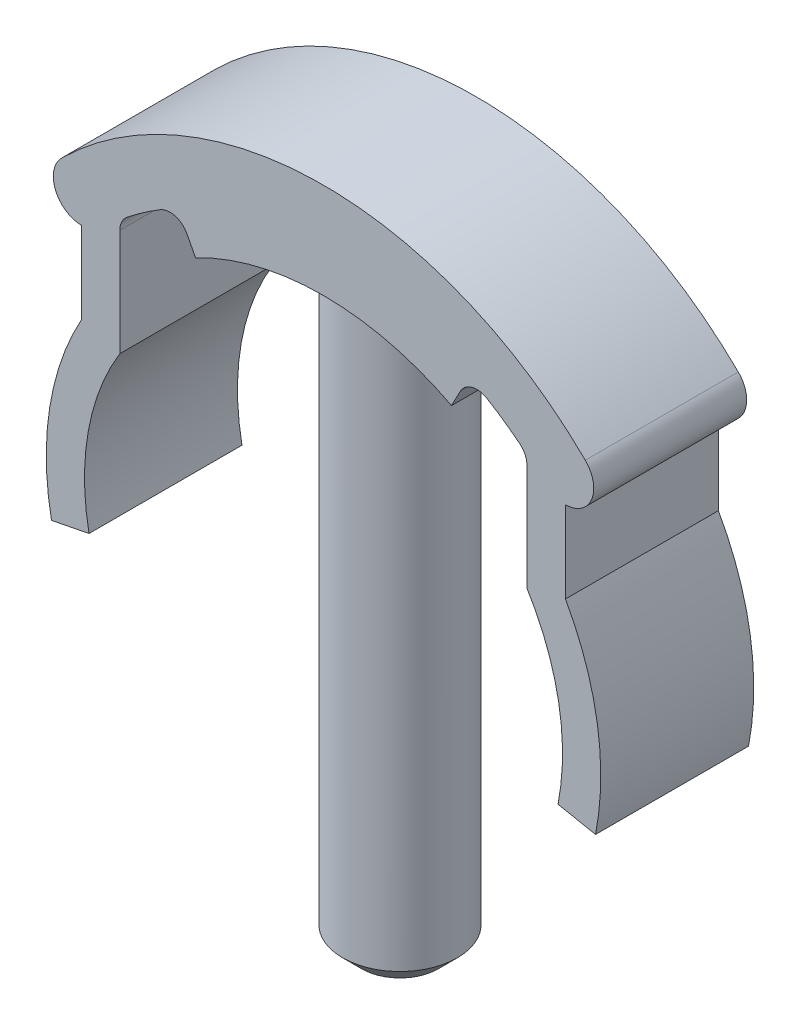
ISO-10303-21;
HEADER;
FILE_DESCRIPTION(('STEP AP214'),'2;1');
FILE_NAME('part.step','',(''),(''),'','','');
FILE_SCHEMA(('AUTOMOTIVE_DESIGN { 1 0 10303 214 1 1 1 1 }'));
ENDSEC;
DATA;
#1=APPLICATION_CONTEXT('core data for automotive mechanical design processes');
#2=APPLICATION_PROTOCOL_DEFINITION('international standard','automotive_design',2000,#1);
#3=PRODUCT_CONTEXT('',#1,'mechanical');
#4=PRODUCT('Part','Part','',(#3));
#5=PRODUCT_RELATED_PRODUCT_CATEGORY('part','',(#4));
#6=PRODUCT_DEFINITION_FORMATION('','',#4);
#7=PRODUCT_DEFINITION_CONTEXT('part definition',#1,'design');
#8=PRODUCT_DEFINITION('design','',#6,#7);
#9=PRODUCT_DEFINITION_SHAPE('','',#8);
#10=(LENGTH_UNIT() NAMED_UNIT(*) SI_UNIT(.MILLI.,.METRE.));
#11=(NAMED_UNIT(*) PLANE_ANGLE_UNIT() SI_UNIT($,.RADIAN.));
#12=(NAMED_UNIT(*) SI_UNIT($,.STERADIAN.) SOLID_ANGLE_UNIT());
#13=UNCERTAINTY_MEASURE_WITH_UNIT(LENGTH_MEASURE(1.E-05),#10,'distance_accuracy_value','');
#14=(GEOMETRIC_REPRESENTATION_CONTEXT(3) GLOBAL_UNCERTAINTY_ASSIGNED_CONTEXT((#13)) GLOBAL_UNIT_ASSIGNED_CONTEXT((#10,
#11,#12)) REPRESENTATION_CONTEXT('',''));
#15=CARTESIAN_POINT('',(0.,0.,0.));
#16=DIRECTION('',(0.,0.,1.));
#17=DIRECTION('',(1.,0.,0.));
#18=AXIS2_PLACEMENT_3D('',#15,#16,#17);
#19=CARTESIAN_POINT('',(0.,0.,8.));
#20=DIRECTION('',(0.,0.,-1.));
#21=DIRECTION('',(-1.,0.,0.));
#22=AXIS2_PLACEMENT_3D('',#19,#20,#21);
#23=CYLINDRICAL_SURFACE('',#22,14.5);
#24=CARTESIAN_POINT('',(0.,0.,0.));
#25=DIRECTION('',(0.,0.,1.));
#26=DIRECTION('',(1.,0.,0.));
#27=AXIS2_PLACEMENT_3D('',#24,#25,#26);
#28=CIRCLE('',#27,14.5);
#29=CARTESIAN_POINT('',(6.69367429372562,12.8625318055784,0.));
#30=VERTEX_POINT('',#29);
#31=CARTESIAN_POINT('',(-6.69367429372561,12.8625318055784,0.));
#32=VERTEX_POINT('',#31);
#33=EDGE_CURVE('E220',#30,#32,#28,.T.);
#34=ORIENTED_EDGE('',*,*,#33,.F.);
#35=DIRECTION('',(0.,0.,-1.));
#36=VECTOR('',#35,1.);
#37=CARTESIAN_POINT('',(6.69367429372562,12.8625318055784,8.));
#38=LINE('',#37,#36);
#39=CARTESIAN_POINT('',(6.69367429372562,12.8625318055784,8.));
#40=VERTEX_POINT('',#39);
#41=EDGE_CURVE('E311',#40,#30,#38,.T.);
#42=ORIENTED_EDGE('',*,*,#41,.F.);
#43=CARTESIAN_POINT('',(0.,0.,8.));
#44=DIRECTION('',(0.,0.,1.));
#45=DIRECTION('',(1.,0.,0.));
#46=AXIS2_PLACEMENT_3D('',#43,#44,#45);
#47=CIRCLE('',#46,14.5);
#48=CARTESIAN_POINT('',(-6.69367429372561,12.8625318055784,8.));
#49=VERTEX_POINT('',#48);
#50=EDGE_CURVE('E358',#40,#49,#47,.T.);
#51=ORIENTED_EDGE('',*,*,#50,.T.);
#52=DIRECTION('',(0.,0.,-1.));
#53=VECTOR('',#52,1.);
#54=CARTESIAN_POINT('',(-6.69367429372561,12.8625318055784,8.));
#55=LINE('',#54,#53);
#56=EDGE_CURVE('E313',#49,#32,#55,.T.);
#57=ORIENTED_EDGE('',*,*,#56,.T.);
#58=EDGE_LOOP('',(#34,#42,#51,#57));
#59=FACE_BOUND('',#58,.T.);
#60=CARTESIAN_POINT('',(0.,14.5,1.));
#61=CARTESIAN_POINT('',(0.16660780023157,14.4999969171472,1.00000597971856));
#62=CARTESIAN_POINT('',(0.333289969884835,14.497099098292,1.01392596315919));
#63=CARTESIAN_POINT('',(0.661934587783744,14.4858187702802,1.06918903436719));
#64=CARTESIAN_POINT('',(0.823893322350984,14.4774320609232,1.11055312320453));
#65=CARTESIAN_POINT('',(1.1382926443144,14.4561094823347,1.21936519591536));
#66=CARTESIAN_POINT('',(1.29074247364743,14.4431781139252,1.2867873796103));
#67=CARTESIAN_POINT('',(1.58215766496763,14.4141683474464,1.44572320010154));
#68=CARTESIAN_POINT('',(1.72112366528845,14.3980900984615,1.53723569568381));
#69=CARTESIAN_POINT('',(1.98364227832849,14.3642935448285,1.74315480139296));
#70=CARTESIAN_POINT('',(2.10697214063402,14.3465567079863,1.85784237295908));
#71=CARTESIAN_POINT('',(2.33278785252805,14.311575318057,2.10625237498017));
#72=CARTESIAN_POINT('',(2.43527199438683,14.2943308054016,2.23997636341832));
#73=CARTESIAN_POINT('',(2.61744767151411,14.262104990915,2.52428159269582));
#74=CARTESIAN_POINT('',(2.69690623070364,14.2471475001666,2.67501505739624));
#75=CARTESIAN_POINT('',(2.82928200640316,14.2214535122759,2.98805456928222));
#76=CARTESIAN_POINT('',(2.88220204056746,14.2107165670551,3.15035938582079));
#77=CARTESIAN_POINT('',(2.95927072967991,14.1948673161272,3.47953056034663));
#78=CARTESIAN_POINT('',(2.98381150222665,14.1896784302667,3.64630134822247));
#79=CARTESIAN_POINT('',(3.00464346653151,14.1852824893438,3.98166762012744));
#80=CARTESIAN_POINT('',(3.00093775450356,14.1860747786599,4.15026290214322));
#81=CARTESIAN_POINT('',(2.96569844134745,14.193482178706,4.48160709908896));
#82=CARTESIAN_POINT('',(2.93461648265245,14.2000027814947,4.64440647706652));
#83=CARTESIAN_POINT('',(2.84622082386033,14.2179830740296,4.96242893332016));
#84=CARTESIAN_POINT('',(2.78890579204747,14.2294430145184,5.11765162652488));
#85=CARTESIAN_POINT('',(2.64924566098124,14.25610610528,5.4174046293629));
#86=CARTESIAN_POINT('',(2.56672347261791,14.271335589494,5.56184999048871));
#87=CARTESIAN_POINT('',(2.37911632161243,14.3038051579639,5.83501160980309));
#88=CARTESIAN_POINT('',(2.27402859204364,14.3210454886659,5.96372593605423));
#89=CARTESIAN_POINT('',(2.04186506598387,14.3560022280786,6.20437578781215));
#90=CARTESIAN_POINT('',(1.91440429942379,14.3737214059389,6.31593984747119));
#91=CARTESIAN_POINT('',(1.64238706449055,14.4073354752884,6.51616478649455));
#92=CARTESIAN_POINT('',(1.49783034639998,14.4232303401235,6.60482533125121));
#93=CARTESIAN_POINT('',(1.19529742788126,14.4514482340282,6.75680341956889));
#94=CARTESIAN_POINT('',(1.03729815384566,14.4637649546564,6.82007627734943));
#95=CARTESIAN_POINT('',(0.712600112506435,14.4833913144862,6.9190748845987));
#96=CARTESIAN_POINT('',(0.545902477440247,14.4907016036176,6.95480420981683));
#97=CARTESIAN_POINT('',(0.211729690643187,14.4994001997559,6.99717047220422));
#98=CARTESIAN_POINT('',(0.0443215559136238,14.5008919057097,7.00431542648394));
#99=CARTESIAN_POINT('',(-0.289296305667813,14.4980733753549,6.99068143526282));
#100=CARTESIAN_POINT('',(-0.455506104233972,14.4937634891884,6.96990417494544));
#101=CARTESIAN_POINT('',(-0.780354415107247,14.4798909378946,6.90143734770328));
#102=CARTESIAN_POINT('',(-0.939050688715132,14.4703795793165,6.85401052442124));
#103=CARTESIAN_POINT('',(-1.24623744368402,14.4471672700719,6.73387957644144));
#104=CARTESIAN_POINT('',(-1.39472712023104,14.4334659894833,6.66117346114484));
#105=CARTESIAN_POINT('',(-1.67941316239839,14.4031368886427,6.49146335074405));
#106=CARTESIAN_POINT('',(-1.81542489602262,14.3864733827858,6.39415615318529));
#107=CARTESIAN_POINT('',(-2.06937139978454,14.3521479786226,6.1784096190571));
#108=CARTESIAN_POINT('',(-2.18730408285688,14.3344859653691,6.05996784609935));
#109=CARTESIAN_POINT('',(-2.40372275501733,14.2998025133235,5.80299472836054));
#110=CARTESIAN_POINT('',(-2.50185886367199,14.2827962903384,5.66416630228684));
#111=CARTESIAN_POINT('',(-2.67342153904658,14.2516823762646,5.37169811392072));
#112=CARTESIAN_POINT('',(-2.746849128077,14.2375745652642,5.21805896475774));
#113=CARTESIAN_POINT('',(-2.8664435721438,14.2139797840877,4.90112624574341));
#114=CARTESIAN_POINT('',(-2.91275662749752,14.2044680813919,4.73788977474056));
#115=CARTESIAN_POINT('',(-2.97724578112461,14.1910926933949,4.40573237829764));
#116=CARTESIAN_POINT('',(-2.99542584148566,14.1872282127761,4.23681225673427));
#117=CARTESIAN_POINT('',(-3.00297832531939,14.185631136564,3.9016005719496));
#118=CARTESIAN_POINT('',(-2.99290425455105,14.187780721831,3.73532179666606));
#119=CARTESIAN_POINT('',(-2.94546170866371,14.1977051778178,3.40688470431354));
#120=CARTESIAN_POINT('',(-2.90809348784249,14.2054799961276,3.24472634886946));
#121=CARTESIAN_POINT('',(-2.80737778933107,14.2257244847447,2.92951675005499));
#122=CARTESIAN_POINT('',(-2.74410274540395,14.2381810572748,2.77644146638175));
#123=CARTESIAN_POINT('',(-2.59343500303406,14.2663920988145,2.48299457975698));
#124=CARTESIAN_POINT('',(-2.5060401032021,14.2821468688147,2.34262413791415));
#125=CARTESIAN_POINT('',(-2.30774256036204,14.3155365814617,2.07582516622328));
#126=CARTESIAN_POINT('',(-2.19644204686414,14.3332004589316,1.94969591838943));
#127=CARTESIAN_POINT('',(-1.95430886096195,14.3682153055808,1.71772206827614));
#128=CARTESIAN_POINT('',(-1.82347169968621,14.385566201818,1.6118821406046));
#129=CARTESIAN_POINT('',(-1.54419363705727,14.4182327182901,1.42235166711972));
#130=CARTESIAN_POINT('',(-1.39556989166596,14.4335230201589,1.33892597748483));
#131=CARTESIAN_POINT('',(-1.08613294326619,14.4600948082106,1.19836854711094));
#132=CARTESIAN_POINT('',(-0.925330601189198,14.4713798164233,1.14121369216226));
#133=CARTESIAN_POINT('',(-0.636863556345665,14.4865407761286,1.06557536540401));
#134=CARTESIAN_POINT('',(-0.510813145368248,14.4915578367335,1.04102953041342));
#135=CARTESIAN_POINT('',(-0.256523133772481,14.4982885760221,1.00823983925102));
#136=CARTESIAN_POINT('',(-0.128283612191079,14.5000023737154,0.999995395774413));
#137=CARTESIAN_POINT('',(0.,14.5,1.));
#138=B_SPLINE_CURVE_WITH_KNOTS('',3,(#60,#61,#62,#63,#64,#65,#66,#67,#68,#69,#70,#71,#72,#73,
#74,#75,#76,#77,#78,#79,#80,#81,#82,#83,#84,#85,#86,#87,#88,#89,#90,#91,#92,#93,#94,#95,#96,#97,
#98,#99,#100,#101,#102,#103,#104,#105,#106,#107,#108,#109,#110,#111,#112,#113,#114,#115,#116,
#117,#118,#119,#120,#121,#122,#123,#124,#125,#126,#127,#128,#129,#130,#131,#132,#133,#134,#135,
#136,#137),.UNSPECIFIED.,.T.,.F.,(4,2,2,2,2,2,2,2,2,2,2,2,2,2,2,2,2,2,2,2,2,2,2,2,2,2,2,2,2,2,2,
2,2,2,2,2,2,2,4),(0.,0.49935400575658,0.999090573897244,1.49833361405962,1.99755300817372,
2.50323314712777,3.00895469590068,3.51962754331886,4.03024615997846,4.53372190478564,
5.03714246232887,5.53241016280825,6.02770300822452,6.52655876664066,7.02547572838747,
7.53401467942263,8.04256105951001,8.55199866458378,9.06137012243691,9.56164742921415,
10.0618945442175,10.5572940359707,11.0527325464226,11.5546032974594,12.0565319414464,
12.5666757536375,13.0767984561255,13.5841446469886,14.091419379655,14.5888262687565,
15.0862285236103,15.5822494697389,16.0783157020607,16.5833854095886,17.0885713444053,
17.5994875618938,18.1099533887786,18.4944566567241,18.8789460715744),.UNSPECIFIED.);
#139=CARTESIAN_POINT('',(0.,14.5,1.));
#140=VERTEX_POINT('',#139);
#141=EDGE_CURVE('E217',#140,#140,#138,.T.);
#142=ORIENTED_EDGE('',*,*,#141,.F.);
#143=EDGE_LOOP('',(#142));
#144=FACE_BOUND('',#143,.T.);
#145=ADVANCED_FACE('F33',(#59,#144),#23,.F.);
#146=CARTESIAN_POINT('',(-8.02747125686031,13.2593252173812,8.));
#147=DIRECTION('',(0.,0.,-1.));
#148=DIRECTION('',(-1.,0.,0.));
#149=AXIS2_PLACEMENT_3D('',#146,#147,#148);
#150=CYLINDRICAL_SURFACE('',#149,1.);
#151=CARTESIAN_POINT('',(-8.02747125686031,13.2593252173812,0.));
#152=DIRECTION('',(0.,0.,1.));
#153=DIRECTION('',(1.,0.,0.));
#154=AXIS2_PLACEMENT_3D('',#151,#152,#153);
#155=CIRCLE('',#154,1.);
#156=CARTESIAN_POINT('',(-7.1404000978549,13.7209579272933,0.));
#157=VERTEX_POINT('',#156);
#158=CARTESIAN_POINT('',(-8.54537262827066,14.1147655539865,0.));
#159=VERTEX_POINT('',#158);
#160=EDGE_CURVE('E214',#157,#159,#155,.T.);
#161=ORIENTED_EDGE('',*,*,#160,.F.);
#162=DIRECTION('',(0.,0.,-1.));
#163=VECTOR('',#162,1.);
#164=CARTESIAN_POINT('',(-7.1404000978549,13.7209579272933,8.));
#165=LINE('',#164,#163);
#166=CARTESIAN_POINT('',(-7.1404000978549,13.7209579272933,8.));
#167=VERTEX_POINT('',#166);
#168=EDGE_CURVE('E128',#167,#157,#165,.T.);
#169=ORIENTED_EDGE('',*,*,#168,.F.);
#170=CARTESIAN_POINT('',(-8.02747125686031,13.2593252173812,8.));
#171=DIRECTION('',(0.,0.,1.));
#172=DIRECTION('',(1.,0.,0.));
#173=AXIS2_PLACEMENT_3D('',#170,#171,#172);
#174=CIRCLE('',#173,1.);
#175=CARTESIAN_POINT('',(-8.54537262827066,14.1147655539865,8.));
#176=VERTEX_POINT('',#175);
#177=EDGE_CURVE('E271',#167,#176,#174,.T.);
#178=ORIENTED_EDGE('',*,*,#177,.T.);
#179=DIRECTION('',(0.,0.,-1.));
#180=VECTOR('',#179,1.);
#181=CARTESIAN_POINT('',(-8.54537262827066,14.1147655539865,8.));
#182=LINE('',#181,#180);
#183=EDGE_CURVE('E50',#176,#159,#182,.T.);
#184=ORIENTED_EDGE('',*,*,#183,.T.);
#185=EDGE_LOOP('',(#161,#169,#178,#184));
#186=FACE_BOUND('',#185,.T.);
#187=ADVANCED_FACE('F329',(#186),#150,.F.);
#188=CARTESIAN_POINT('',(15.4344198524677,-29.6587057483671,8.));
#189=DIRECTION('',(-0.887071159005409,-0.461632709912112,0.));
#190=DIRECTION('',(0.461632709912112,-0.887071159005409,0.));
#191=AXIS2_PLACEMENT_3D('',#188,#189,#190);
#192=PLANE('',#191);
#193=DIRECTION('',(-0.461632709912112,0.887071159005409,0.));
#194=VECTOR('',#193,1.);
#195=CARTESIAN_POINT('',(15.4344198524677,-29.6587057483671,0.));
#196=LINE('',#195,#194);
#197=EDGE_CURVE('E216',#32,#157,#196,.T.);
#198=ORIENTED_EDGE('',*,*,#197,.F.);
#199=ORIENTED_EDGE('',*,*,#56,.F.);
#200=DIRECTION('',(-0.461632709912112,0.887071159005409,0.));
#201=VECTOR('',#200,1.);
#202=CARTESIAN_POINT('',(15.4344198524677,-29.6587057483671,8.));
#203=LINE('',#202,#201);
#204=EDGE_CURVE('E360',#49,#167,#203,.T.);
#205=ORIENTED_EDGE('',*,*,#204,.T.);
#206=ORIENTED_EDGE('',*,*,#168,.T.);
#207=EDGE_LOOP('',(#198,#199,#205,#206));
#208=FACE_BOUND('',#207,.T.);
#209=ADVANCED_FACE('F335',(#208),#192,.T.);
#210=CARTESIAN_POINT('',(-15.4344198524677,-29.6587057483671,8.));
#211=DIRECTION('',(-0.887071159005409,0.461632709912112,0.));
#212=DIRECTION('',(-0.461632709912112,-0.887071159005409,0.));
#213=AXIS2_PLACEMENT_3D('',#210,#211,#212);
#214=PLANE('',#213);
#215=DIRECTION('',(0.461632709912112,0.887071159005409,0.));
#216=VECTOR('',#215,1.);
#217=CARTESIAN_POINT('',(-15.4344198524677,-29.6587057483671,0.));
#218=LINE('',#217,#216);
#219=CARTESIAN_POINT('',(7.1404000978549,13.7209579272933,0.));
#220=VERTEX_POINT('',#219);
#221=EDGE_CURVE('E223',#30,#220,#218,.T.);
#222=ORIENTED_EDGE('',*,*,#221,.T.);
#223=DIRECTION('',(0.,0.,-1.));
#224=VECTOR('',#223,1.);
#225=CARTESIAN_POINT('',(7.1404000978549,13.7209579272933,8.));
#226=LINE('',#225,#224);
#227=CARTESIAN_POINT('',(7.1404000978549,13.7209579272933,8.));
#228=VERTEX_POINT('',#227);
#229=EDGE_CURVE('E309',#228,#220,#226,.T.);
#230=ORIENTED_EDGE('',*,*,#229,.F.);
#231=DIRECTION('',(0.461632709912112,0.887071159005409,0.));
#232=VECTOR('',#231,1.);
#233=CARTESIAN_POINT('',(-15.4344198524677,-29.6587057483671,8.));
#234=LINE('',#233,#232);
#235=EDGE_CURVE('E359',#40,#228,#234,.T.);
#236=ORIENTED_EDGE('',*,*,#235,.F.);
#237=ORIENTED_EDGE('',*,*,#41,.T.);
#238=EDGE_LOOP('',(#222,#230,#236,#237));
#239=FACE_BOUND('',#238,.T.);
#240=ADVANCED_FACE('F340',(#239),#214,.F.);
#241=CARTESIAN_POINT('',(8.02747125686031,13.2593252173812,8.));
#242=DIRECTION('',(0.,0.,-1.));
#243=DIRECTION('',(-1.,0.,0.));
#244=AXIS2_PLACEMENT_3D('',#241,#242,#243);
#245=CYLINDRICAL_SURFACE('',#244,1.);
#246=CARTESIAN_POINT('',(8.02747125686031,13.2593252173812,0.));
#247=DIRECTION('',(0.,0.,1.));
#248=DIRECTION('',(1.,0.,0.));
#249=AXIS2_PLACEMENT_3D('',#246,#247,#248);
#250=CIRCLE('',#249,1.);
#251=CARTESIAN_POINT('',(8.54537262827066,14.1147655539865,0.));
#252=VERTEX_POINT('',#251);
#253=EDGE_CURVE('E226',#252,#220,#250,.T.);
#254=ORIENTED_EDGE('',*,*,#253,.F.);
#255=DIRECTION('',(0.,0.,-1.));
#256=VECTOR('',#255,1.);
#257=CARTESIAN_POINT('',(8.54537262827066,14.1147655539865,8.));
#258=LINE('',#257,#256);
#259=CARTESIAN_POINT('',(8.54537262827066,14.1147655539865,8.));
#260=VERTEX_POINT('',#259);
#261=EDGE_CURVE('E307',#260,#252,#258,.T.);
#262=ORIENTED_EDGE('',*,*,#261,.F.);
#263=CARTESIAN_POINT('',(8.02747125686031,13.2593252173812,8.));
#264=DIRECTION('',(0.,0.,1.));
#265=DIRECTION('',(1.,0.,0.));
#266=AXIS2_PLACEMENT_3D('',#263,#264,#265);
#267=CIRCLE('',#266,1.);
#268=EDGE_CURVE('E362',#260,#228,#267,.T.);
#269=ORIENTED_EDGE('',*,*,#268,.T.);
#270=ORIENTED_EDGE('',*,*,#229,.T.);
#271=EDGE_LOOP('',(#254,#262,#269,#270));
#272=FACE_BOUND('',#271,.T.);
#273=ADVANCED_FACE('F347',(#272),#245,.F.);
#274=CARTESIAN_POINT('',(0.,0.,8.));
#275=DIRECTION('',(0.,0.,-1.));
#276=DIRECTION('',(-1.,0.,0.));
#277=AXIS2_PLACEMENT_3D('',#274,#275,#276);
#278=CYLINDRICAL_SURFACE('',#277,16.5);
#279=CARTESIAN_POINT('',(0.,0.,0.));
#280=DIRECTION('',(0.,0.,1.));
#281=DIRECTION('',(1.,0.,0.));
#282=AXIS2_PLACEMENT_3D('',#279,#280,#281);
#283=CIRCLE('',#282,16.5);
#284=CARTESIAN_POINT('',(10.2581611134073,12.9236268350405,0.));
#285=VERTEX_POINT('',#284);
#286=EDGE_CURVE('E229',#285,#252,#283,.T.);
#287=ORIENTED_EDGE('',*,*,#286,.F.);
#288=DIRECTION('',(0.,0.,-1.));
#289=VECTOR('',#288,1.);
#290=CARTESIAN_POINT('',(10.2581611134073,12.9236268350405,8.));
#291=LINE('',#290,#289);
#292=CARTESIAN_POINT('',(10.2581611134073,12.9236268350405,8.));
#293=VERTEX_POINT('',#292);
#294=EDGE_CURVE('E305',#293,#285,#291,.T.);
#295=ORIENTED_EDGE('',*,*,#294,.F.);
#296=CARTESIAN_POINT('',(0.,0.,8.));
#297=DIRECTION('',(0.,0.,1.));
#298=DIRECTION('',(1.,0.,0.));
#299=AXIS2_PLACEMENT_3D('',#296,#297,#298);
#300=CIRCLE('',#299,16.5);
#301=EDGE_CURVE('E369',#293,#260,#300,.T.);
#302=ORIENTED_EDGE('',*,*,#301,.T.);
#303=ORIENTED_EDGE('',*,*,#261,.T.);
#304=EDGE_LOOP('',(#287,#295,#302,#303));
#305=FACE_BOUND('',#304,.T.);
#306=ADVANCED_FACE('F466',(#305),#278,.F.);
#307=CARTESIAN_POINT('',(9.63645437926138,12.1403767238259,8.));
#308=DIRECTION('',(0.,0.,-1.));
#309=DIRECTION('',(-1.,0.,0.));
#310=AXIS2_PLACEMENT_3D('',#307,#308,#309);
#311=CYLINDRICAL_SURFACE('',#310,1.);
#312=CARTESIAN_POINT('',(9.63645437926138,12.1403767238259,0.));
#313=DIRECTION('',(0.,0.,1.));
#314=DIRECTION('',(1.,0.,0.));
#315=AXIS2_PLACEMENT_3D('',#312,#313,#314);
#316=CIRCLE('',#315,1.);
#317=CARTESIAN_POINT('',(10.6364543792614,12.1403767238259,0.));
#318=VERTEX_POINT('',#317);
#319=EDGE_CURVE('E232',#318,#285,#316,.T.);
#320=ORIENTED_EDGE('',*,*,#319,.F.);
#321=DIRECTION('',(0.,0.,-1.));
#322=VECTOR('',#321,1.);
#323=CARTESIAN_POINT('',(10.6364543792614,12.1403767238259,8.));
#324=LINE('',#323,#322);
#325=CARTESIAN_POINT('',(10.6364543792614,12.1403767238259,8.));
#326=VERTEX_POINT('',#325);
#327=EDGE_CURVE('E303',#326,#318,#324,.T.);
#328=ORIENTED_EDGE('',*,*,#327,.F.);
#329=CARTESIAN_POINT('',(9.63645437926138,12.1403767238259,8.));
#330=DIRECTION('',(0.,0.,1.));
#331=DIRECTION('',(1.,0.,0.));
#332=AXIS2_PLACEMENT_3D('',#329,#330,#331);
#333=CIRCLE('',#332,1.);
#334=EDGE_CURVE('E372',#326,#293,#333,.T.);
#335=ORIENTED_EDGE('',*,*,#334,.T.);
#336=ORIENTED_EDGE('',*,*,#294,.T.);
#337=EDGE_LOOP('',(#320,#328,#335,#336));
#338=FACE_BOUND('',#337,.T.);
#339=ADVANCED_FACE('F462',(#338),#311,.F.);
#340=CARTESIAN_POINT('',(10.6364543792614,-37.6907931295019,8.));
#341=DIRECTION('',(1.,0.,0.));
#342=DIRECTION('',(0.,1.,0.));
#343=AXIS2_PLACEMENT_3D('',#340,#341,#342);
#344=PLANE('',#343);
#345=DIRECTION('',(0.,-1.,0.));
#346=VECTOR('',#345,1.);
#347=CARTESIAN_POINT('',(10.6364543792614,-37.6907931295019,0.));
#348=LINE('',#347,#346);
#349=CARTESIAN_POINT('',(10.6364543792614,6.56626516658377,0.));
#350=VERTEX_POINT('',#349);
#351=EDGE_CURVE('E235',#318,#350,#348,.T.);
#352=ORIENTED_EDGE('',*,*,#351,.T.);
#353=DIRECTION('',(0.,0.,-1.));
#354=VECTOR('',#353,1.);
#355=CARTESIAN_POINT('',(10.6364543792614,6.56626516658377,8.));
#356=LINE('',#355,#354);
#357=CARTESIAN_POINT('',(10.6364543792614,6.56626516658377,8.));
#358=VERTEX_POINT('',#357);
#359=EDGE_CURVE('E301',#358,#350,#356,.T.);
#360=ORIENTED_EDGE('',*,*,#359,.F.);
#361=DIRECTION('',(0.,-1.,0.));
#362=VECTOR('',#361,1.);
#363=CARTESIAN_POINT('',(10.6364543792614,-37.6907931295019,8.));
#364=LINE('',#363,#362);
#365=EDGE_CURVE('E375',#326,#358,#364,.T.);
#366=ORIENTED_EDGE('',*,*,#365,.F.);
#367=ORIENTED_EDGE('',*,*,#327,.T.);
#368=EDGE_LOOP('',(#352,#360,#366,#367));
#369=FACE_BOUND('',#368,.T.);
#370=ADVANCED_FACE('F458',(#369),#344,.F.);
#371=CARTESIAN_POINT('',(0.,0.,8.));
#372=DIRECTION('',(0.,0.,-1.));
#373=DIRECTION('',(-1.,0.,0.));
#374=AXIS2_PLACEMENT_3D('',#371,#372,#373);
#375=CYLINDRICAL_SURFACE('',#374,12.5);
#376=CARTESIAN_POINT('',(0.,0.,0.));
#377=DIRECTION('',(0.,0.,1.));
#378=DIRECTION('',(1.,0.,0.));
#379=AXIS2_PLACEMENT_3D('',#376,#377,#378);
#380=CIRCLE('',#379,12.5);
#381=CARTESIAN_POINT('',(12.265,-2.41242098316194,0.));
#382=VERTEX_POINT('',#381);
#383=EDGE_CURVE('E238',#382,#350,#380,.T.);
#384=ORIENTED_EDGE('',*,*,#383,.F.);
#385=DIRECTION('',(0.,0.,-1.));
#386=VECTOR('',#385,1.);
#387=CARTESIAN_POINT('',(12.265,-2.41242098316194,8.));
#388=LINE('',#387,#386);
#389=CARTESIAN_POINT('',(12.265,-2.41242098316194,8.));
#390=VERTEX_POINT('',#389);
#391=EDGE_CURVE('E299',#390,#382,#388,.T.);
#392=ORIENTED_EDGE('',*,*,#391,.F.);
#393=CARTESIAN_POINT('',(0.,0.,8.));
#394=DIRECTION('',(0.,0.,1.));
#395=DIRECTION('',(1.,0.,0.));
#396=AXIS2_PLACEMENT_3D('',#393,#394,#395);
#397=CIRCLE('',#396,12.5);
#398=EDGE_CURVE('E377',#390,#358,#397,.T.);
#399=ORIENTED_EDGE('',*,*,#398,.T.);
#400=ORIENTED_EDGE('',*,*,#359,.T.);
#401=EDGE_LOOP('',(#384,#392,#399,#400));
#402=FACE_BOUND('',#401,.T.);
#403=ADVANCED_FACE('F454',(#402),#375,.F.);
#404=CARTESIAN_POINT('',(7.13733202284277,-1.40385238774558,8.));
#405=DIRECTION('',(0.192993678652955,0.9812,0.));
#406=DIRECTION('',(-0.9812,0.192993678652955,0.));
#407=AXIS2_PLACEMENT_3D('',#404,#405,#406);
#408=PLANE('',#407);
#409=DIRECTION('',(0.9812,-0.192993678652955,0.));
#410=VECTOR('',#409,1.);
#411=CARTESIAN_POINT('',(7.13733202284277,-1.40385238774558,0.));
#412=LINE('',#411,#410);
#413=CARTESIAN_POINT('',(14.2274,-2.79840834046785,0.));
#414=VERTEX_POINT('',#413);
#415=EDGE_CURVE('E241',#382,#414,#412,.T.);
#416=ORIENTED_EDGE('',*,*,#415,.T.);
#417=DIRECTION('',(0.,0.,-1.));
#418=VECTOR('',#417,1.);
#419=CARTESIAN_POINT('',(14.2274,-2.79840834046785,8.));
#420=LINE('',#419,#418);
#421=CARTESIAN_POINT('',(14.2274,-2.79840834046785,8.));
#422=VERTEX_POINT('',#421);
#423=EDGE_CURVE('E296',#422,#414,#420,.T.);
#424=ORIENTED_EDGE('',*,*,#423,.F.);
#425=DIRECTION('',(0.9812,-0.192993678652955,0.));
#426=VECTOR('',#425,1.);
#427=CARTESIAN_POINT('',(7.13733202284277,-1.40385238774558,8.));
#428=LINE('',#427,#426);
#429=EDGE_CURVE('E380',#390,#422,#428,.T.);
#430=ORIENTED_EDGE('',*,*,#429,.F.);
#431=ORIENTED_EDGE('',*,*,#391,.T.);
#432=EDGE_LOOP('',(#416,#424,#430,#431));
#433=FACE_BOUND('',#432,.T.);
#434=ADVANCED_FACE('F450',(#433),#408,.F.);
#435=CARTESIAN_POINT('',(0.,0.,8.));
#436=DIRECTION('',(0.,0.,-1.));
#437=DIRECTION('',(-1.,0.,0.));
#438=AXIS2_PLACEMENT_3D('',#435,#436,#437);
#439=CYLINDRICAL_SURFACE('',#438,14.5);
#440=CARTESIAN_POINT('',(0.,0.,0.));
#441=DIRECTION('',(0.,0.,1.));
#442=DIRECTION('',(1.,0.,0.));
#443=AXIS2_PLACEMENT_3D('',#440,#441,#442);
#444=CIRCLE('',#443,14.5);
#445=CARTESIAN_POINT('',(12.6535456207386,7.08080385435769,0.));
#446=VERTEX_POINT('',#445);
#447=EDGE_CURVE('E243',#414,#446,#444,.T.);
#448=ORIENTED_EDGE('',*,*,#447,.T.);
#449=DIRECTION('',(0.,0.,-1.));
#450=VECTOR('',#449,1.);
#451=CARTESIAN_POINT('',(12.6535456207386,7.08080385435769,8.));
#452=LINE('',#451,#450);
#453=CARTESIAN_POINT('',(12.6535456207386,7.08080385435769,8.));
#454=VERTEX_POINT('',#453);
#455=EDGE_CURVE('E294',#454,#446,#452,.T.);
#456=ORIENTED_EDGE('',*,*,#455,.F.);
#457=CARTESIAN_POINT('',(0.,0.,8.));
#458=DIRECTION('',(0.,0.,1.));
#459=DIRECTION('',(1.,0.,0.));
#460=AXIS2_PLACEMENT_3D('',#457,#458,#459);
#461=CIRCLE('',#460,14.5);
#462=EDGE_CURVE('E382',#422,#454,#461,.T.);
#463=ORIENTED_EDGE('',*,*,#462,.F.);
#464=ORIENTED_EDGE('',*,*,#423,.T.);
#465=EDGE_LOOP('',(#448,#456,#463,#464));
#466=FACE_BOUND('',#465,.T.);
#467=ADVANCED_FACE('F446',(#466),#439,.T.);
#468=CARTESIAN_POINT('',(12.6535456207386,-37.6907931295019,8.));
#469=DIRECTION('',(1.,0.,0.));
#470=DIRECTION('',(0.,1.,0.));
#471=AXIS2_PLACEMENT_3D('',#468,#469,#470);
#472=PLANE('',#471);
#473=DIRECTION('',(0.,-1.,0.));
#474=VECTOR('',#473,1.);
#475=CARTESIAN_POINT('',(12.6535456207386,-37.6907931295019,0.));
#476=LINE('',#475,#474);
#477=CARTESIAN_POINT('',(12.6535456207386,11.3528755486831,0.));
#478=VERTEX_POINT('',#477);
#479=EDGE_CURVE('E246',#478,#446,#476,.T.);
#480=ORIENTED_EDGE('',*,*,#479,.F.);
#481=DIRECTION('',(0.,0.,-1.));
#482=VECTOR('',#481,1.);
#483=CARTESIAN_POINT('',(12.6535456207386,11.3528755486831,8.));
#484=LINE('',#483,#482);
#485=CARTESIAN_POINT('',(12.6535456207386,11.3528755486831,8.));
#486=VERTEX_POINT('',#485);
#487=EDGE_CURVE('E292',#486,#478,#484,.T.);
#488=ORIENTED_EDGE('',*,*,#487,.F.);
#489=DIRECTION('',(0.,-1.,0.));
#490=VECTOR('',#489,1.);
#491=CARTESIAN_POINT('',(12.6535456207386,-37.6907931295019,8.));
#492=LINE('',#491,#490);
#493=EDGE_CURVE('E384',#486,#454,#492,.T.);
#494=ORIENTED_EDGE('',*,*,#493,.T.);
#495=ORIENTED_EDGE('',*,*,#455,.T.);
#496=EDGE_LOOP('',(#480,#488,#494,#495));
#497=FACE_BOUND('',#496,.T.);
#498=ADVANCED_FACE('F442',(#497),#472,.T.);
#499=CARTESIAN_POINT('',(12.6535456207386,12.8316680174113,8.));
#500=DIRECTION('',(0.,0.,-1.));
#501=DIRECTION('',(-1.,0.,0.));
#502=AXIS2_PLACEMENT_3D('',#499,#500,#501);
#503=CYLINDRICAL_SURFACE('',#502,1.47879246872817);
#504=CARTESIAN_POINT('',(12.6535456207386,12.8316680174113,0.));
#505=DIRECTION('',(0.,0.,1.));
#506=DIRECTION('',(1.,0.,0.));
#507=AXIS2_PLACEMENT_3D('',#504,#505,#506);
#508=CIRCLE('',#507,1.47879246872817);
#509=CARTESIAN_POINT('',(13.6918760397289,13.8846148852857,0.));
#510=VERTEX_POINT('',#509);
#511=EDGE_CURVE('E249',#478,#510,#508,.T.);
#512=ORIENTED_EDGE('',*,*,#511,.T.);
#513=DIRECTION('',(0.,0.,-1.));
#514=VECTOR('',#513,1.);
#515=CARTESIAN_POINT('',(13.6918760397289,13.8846148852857,8.));
#516=LINE('',#515,#514);
#517=CARTESIAN_POINT('',(13.6918760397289,13.8846148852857,8.));
#518=VERTEX_POINT('',#517);
#519=EDGE_CURVE('E289',#518,#510,#516,.T.);
#520=ORIENTED_EDGE('',*,*,#519,.F.);
#521=CARTESIAN_POINT('',(12.6535456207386,12.8316680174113,8.));
#522=DIRECTION('',(0.,0.,1.));
#523=DIRECTION('',(1.,0.,0.));
#524=AXIS2_PLACEMENT_3D('',#521,#522,#523);
#525=CIRCLE('',#524,1.47879246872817);
#526=EDGE_CURVE('E387',#486,#518,#525,.T.);
#527=ORIENTED_EDGE('',*,*,#526,.F.);
#528=ORIENTED_EDGE('',*,*,#487,.T.);
#529=EDGE_LOOP('',(#512,#520,#527,#528));
#530=FACE_BOUND('',#529,.T.);
#531=ADVANCED_FACE('F438',(#530),#503,.T.);
#532=CARTESIAN_POINT('',(0.,0.,8.));
#533=DIRECTION('',(0.,0.,-1.));
#534=DIRECTION('',(-1.,0.,0.));
#535=AXIS2_PLACEMENT_3D('',#532,#533,#534);
#536=CYLINDRICAL_SURFACE('',#535,19.5);
#537=CARTESIAN_POINT('',(0.,0.,0.));
#538=DIRECTION('',(0.,0.,1.));
#539=DIRECTION('',(1.,0.,0.));
#540=AXIS2_PLACEMENT_3D('',#537,#538,#539);
#541=CIRCLE('',#540,19.5);
#542=CARTESIAN_POINT('',(-13.6918760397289,13.8846148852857,0.));
#543=VERTEX_POINT('',#542);
#544=EDGE_CURVE('E251',#510,#543,#541,.T.);
#545=ORIENTED_EDGE('',*,*,#544,.T.);
#546=DIRECTION('',(0.,0.,-1.));
#547=VECTOR('',#546,1.);
#548=CARTESIAN_POINT('',(-13.6918760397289,13.8846148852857,8.));
#549=LINE('',#548,#547);
#550=CARTESIAN_POINT('',(-13.6918760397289,13.8846148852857,8.));
#551=VERTEX_POINT('',#550);
#552=EDGE_CURVE('E286',#551,#543,#549,.T.);
#553=ORIENTED_EDGE('',*,*,#552,.F.);
#554=CARTESIAN_POINT('',(0.,0.,8.));
#555=DIRECTION('',(0.,0.,1.));
#556=DIRECTION('',(1.,0.,0.));
#557=AXIS2_PLACEMENT_3D('',#554,#555,#556);
#558=CIRCLE('',#557,19.5);
#559=EDGE_CURVE('E389',#518,#551,#558,.T.);
#560=ORIENTED_EDGE('',*,*,#559,.F.);
#561=ORIENTED_EDGE('',*,*,#519,.T.);
#562=EDGE_LOOP('',(#545,#553,#560,#561));
#563=FACE_BOUND('',#562,.T.);
#564=ADVANCED_FACE('F434',(#563),#536,.T.);
#565=CARTESIAN_POINT('',(-12.6535456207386,12.8316680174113,8.));
#566=DIRECTION('',(0.,0.,-1.));
#567=DIRECTION('',(-1.,0.,0.));
#568=AXIS2_PLACEMENT_3D('',#565,#566,#567);
#569=CYLINDRICAL_SURFACE('',#568,1.47879246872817);
#570=CARTESIAN_POINT('',(-12.6535456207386,12.8316680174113,0.));
#571=DIRECTION('',(0.,0.,1.));
#572=DIRECTION('',(1.,0.,0.));
#573=AXIS2_PLACEMENT_3D('',#570,#571,#572);
#574=CIRCLE('',#573,1.47879246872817);
#575=CARTESIAN_POINT('',(-12.6535456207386,11.3528755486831,0.));
#576=VERTEX_POINT('',#575);
#577=EDGE_CURVE('E253',#543,#576,#574,.T.);
#578=ORIENTED_EDGE('',*,*,#577,.T.);
#579=DIRECTION('',(0.,0.,-1.));
#580=VECTOR('',#579,1.);
#581=CARTESIAN_POINT('',(-12.6535456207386,11.3528755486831,8.));
#582=LINE('',#581,#580);
#583=CARTESIAN_POINT('',(-12.6535456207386,11.3528755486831,8.));
#584=VERTEX_POINT('',#583);
#585=EDGE_CURVE('E283',#584,#576,#582,.T.);
#586=ORIENTED_EDGE('',*,*,#585,.F.);
#587=CARTESIAN_POINT('',(-12.6535456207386,12.8316680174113,8.));
#588=DIRECTION('',(0.,0.,1.));
#589=DIRECTION('',(1.,0.,0.));
#590=AXIS2_PLACEMENT_3D('',#587,#588,#589);
#591=CIRCLE('',#590,1.47879246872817);
#592=EDGE_CURVE('E391',#551,#584,#591,.T.);
#593=ORIENTED_EDGE('',*,*,#592,.F.);
#594=ORIENTED_EDGE('',*,*,#552,.T.);
#595=EDGE_LOOP('',(#578,#586,#593,#594));
#596=FACE_BOUND('',#595,.T.);
#597=ADVANCED_FACE('F430',(#596),#569,.T.);
#598=CARTESIAN_POINT('',(-12.6535456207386,-37.6907931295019,8.));
#599=DIRECTION('',(1.,0.,0.));
#600=DIRECTION('',(0.,1.,0.));
#601=AXIS2_PLACEMENT_3D('',#598,#599,#600);
#602=PLANE('',#601);
#603=DIRECTION('',(0.,-1.,0.));
#604=VECTOR('',#603,1.);
#605=CARTESIAN_POINT('',(-12.6535456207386,-37.6907931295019,0.));
#606=LINE('',#605,#604);
#607=CARTESIAN_POINT('',(-12.6535456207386,7.08080385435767,0.));
#608=VERTEX_POINT('',#607);
#609=EDGE_CURVE('E255',#576,#608,#606,.T.);
#610=ORIENTED_EDGE('',*,*,#609,.T.);
#611=DIRECTION('',(0.,0.,-1.));
#612=VECTOR('',#611,1.);
#613=CARTESIAN_POINT('',(-12.6535456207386,7.08080385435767,8.));
#614=LINE('',#613,#612);
#615=CARTESIAN_POINT('',(-12.6535456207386,7.08080385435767,8.));
#616=VERTEX_POINT('',#615);
#617=EDGE_CURVE('E280',#616,#608,#614,.T.);
#618=ORIENTED_EDGE('',*,*,#617,.F.);
#619=DIRECTION('',(0.,-1.,0.));
#620=VECTOR('',#619,1.);
#621=CARTESIAN_POINT('',(-12.6535456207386,-37.6907931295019,8.));
#622=LINE('',#621,#620);
#623=EDGE_CURVE('E393',#584,#616,#622,.T.);
#624=ORIENTED_EDGE('',*,*,#623,.F.);
#625=ORIENTED_EDGE('',*,*,#585,.T.);
#626=EDGE_LOOP('',(#610,#618,#624,#625));
#627=FACE_BOUND('',#626,.T.);
#628=ADVANCED_FACE('F426',(#627),#602,.F.);
#629=CARTESIAN_POINT('',(0.,0.,8.));
#630=DIRECTION('',(0.,0.,-1.));
#631=DIRECTION('',(-1.,0.,0.));
#632=AXIS2_PLACEMENT_3D('',#629,#630,#631);
#633=CYLINDRICAL_SURFACE('',#632,14.5);
#634=CARTESIAN_POINT('',(0.,0.,0.));
#635=DIRECTION('',(0.,0.,1.));
#636=DIRECTION('',(1.,0.,0.));
#637=AXIS2_PLACEMENT_3D('',#634,#635,#636);
#638=CIRCLE('',#637,14.5);
#639=CARTESIAN_POINT('',(-14.2274,-2.79840834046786,0.));
#640=VERTEX_POINT('',#639);
#641=EDGE_CURVE('E257',#608,#640,#638,.T.);
#642=ORIENTED_EDGE('',*,*,#641,.T.);
#643=DIRECTION('',(0.,0.,-1.));
#644=VECTOR('',#643,1.);
#645=CARTESIAN_POINT('',(-14.2274,-2.79840834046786,8.));
#646=LINE('',#645,#644);
#647=CARTESIAN_POINT('',(-14.2274,-2.79840834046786,8.));
#648=VERTEX_POINT('',#647);
#649=EDGE_CURVE('E277',#648,#640,#646,.T.);
#650=ORIENTED_EDGE('',*,*,#649,.F.);
#651=CARTESIAN_POINT('',(0.,0.,8.));
#652=DIRECTION('',(0.,0.,1.));
#653=DIRECTION('',(1.,0.,0.));
#654=AXIS2_PLACEMENT_3D('',#651,#652,#653);
#655=CIRCLE('',#654,14.5);
#656=EDGE_CURVE('E395',#616,#648,#655,.T.);
#657=ORIENTED_EDGE('',*,*,#656,.F.);
#658=ORIENTED_EDGE('',*,*,#617,.T.);
#659=EDGE_LOOP('',(#642,#650,#657,#658));
#660=FACE_BOUND('',#659,.T.);
#661=ADVANCED_FACE('F423',(#660),#633,.T.);
#662=CARTESIAN_POINT('',(-7.13733202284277,-1.40385238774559,8.));
#663=DIRECTION('',(-0.192993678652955,0.9812,0.));
#664=DIRECTION('',(-0.9812,-0.192993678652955,0.));
#665=AXIS2_PLACEMENT_3D('',#662,#663,#664);
#666=PLANE('',#665);
#667=DIRECTION('',(0.9812,0.192993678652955,0.));
#668=VECTOR('',#667,1.);
#669=CARTESIAN_POINT('',(-7.13733202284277,-1.40385238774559,0.));
#670=LINE('',#669,#668);
#671=CARTESIAN_POINT('',(-12.265,-2.41242098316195,0.));
#672=VERTEX_POINT('',#671);
#673=EDGE_CURVE('E259',#640,#672,#670,.T.);
#674=ORIENTED_EDGE('',*,*,#673,.T.);
#675=DIRECTION('',(0.,0.,-1.));
#676=VECTOR('',#675,1.);
#677=CARTESIAN_POINT('',(-12.265,-2.41242098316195,8.));
#678=LINE('',#677,#676);
#679=CARTESIAN_POINT('',(-12.265,-2.41242098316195,8.));
#680=VERTEX_POINT('',#679);
#681=EDGE_CURVE('E275',#680,#672,#678,.T.);
#682=ORIENTED_EDGE('',*,*,#681,.F.);
#683=DIRECTION('',(0.9812,0.192993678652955,0.));
#684=VECTOR('',#683,1.);
#685=CARTESIAN_POINT('',(-7.13733202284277,-1.40385238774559,8.));
#686=LINE('',#685,#684);
#687=EDGE_CURVE('E209',#648,#680,#686,.T.);
#688=ORIENTED_EDGE('',*,*,#687,.F.);
#689=ORIENTED_EDGE('',*,*,#649,.T.);
#690=EDGE_LOOP('',(#674,#682,#688,#689));
#691=FACE_BOUND('',#690,.T.);
#692=ADVANCED_FACE('F401',(#691),#666,.F.);
#693=CARTESIAN_POINT('',(0.,0.,8.));
#694=DIRECTION('',(0.,0.,-1.));
#695=DIRECTION('',(-1.,0.,0.));
#696=AXIS2_PLACEMENT_3D('',#693,#694,#695);
#697=CYLINDRICAL_SURFACE('',#696,12.5);
#698=CARTESIAN_POINT('',(0.,0.,0.));
#699=DIRECTION('',(0.,0.,1.));
#700=DIRECTION('',(1.,0.,0.));
#701=AXIS2_PLACEMENT_3D('',#698,#699,#700);
#702=CIRCLE('',#701,12.5);
#703=CARTESIAN_POINT('',(-10.6535456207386,6.53849873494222,0.));
#704=VERTEX_POINT('',#703);
#705=EDGE_CURVE('E262',#704,#672,#702,.T.);
#706=ORIENTED_EDGE('',*,*,#705,.F.);
#707=DIRECTION('',(0.,0.,-1.));
#708=VECTOR('',#707,1.);
#709=CARTESIAN_POINT('',(-10.6535456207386,6.53849873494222,8.));
#710=LINE('',#709,#708);
#711=CARTESIAN_POINT('',(-10.6535456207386,6.53849873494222,8.));
#712=VERTEX_POINT('',#711);
#713=EDGE_CURVE('E196',#712,#704,#710,.T.);
#714=ORIENTED_EDGE('',*,*,#713,.F.);
#715=CARTESIAN_POINT('',(0.,0.,8.));
#716=DIRECTION('',(0.,0.,1.));
#717=DIRECTION('',(1.,0.,0.));
#718=AXIS2_PLACEMENT_3D('',#715,#716,#717);
#719=CIRCLE('',#718,12.5);
#720=EDGE_CURVE('E207',#712,#680,#719,.T.);
#721=ORIENTED_EDGE('',*,*,#720,.T.);
#722=ORIENTED_EDGE('',*,*,#681,.T.);
#723=EDGE_LOOP('',(#706,#714,#721,#722));
#724=FACE_BOUND('',#723,.T.);
#725=ADVANCED_FACE('F405',(#724),#697,.F.);
#726=CARTESIAN_POINT('',(-10.6535456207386,-37.6907931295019,8.));
#727=DIRECTION('',(1.,0.,0.));
#728=DIRECTION('',(0.,0.,-1.));
#729=AXIS2_PLACEMENT_3D('',#726,#727,#728);
#730=PLANE('',#729);
#731=DIRECTION('',(0.,-1.,0.));
#732=VECTOR('',#731,1.);
#733=CARTESIAN_POINT('',(-10.6535456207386,-37.6907931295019,0.));
#734=LINE('',#733,#732);
#735=CARTESIAN_POINT('',(-10.6535456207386,12.1267908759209,0.));
#736=VERTEX_POINT('',#735);
#737=EDGE_CURVE('E193',#736,#704,#734,.T.);
#738=ORIENTED_EDGE('',*,*,#737,.F.);
#739=DIRECTION('',(0.,0.,-1.));
#740=VECTOR('',#739,1.);
#741=CARTESIAN_POINT('',(-10.6535456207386,12.1267908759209,8.));
#742=LINE('',#741,#740);
#743=CARTESIAN_POINT('',(-10.6535456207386,12.1267908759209,8.));
#744=VERTEX_POINT('',#743);
#745=EDGE_CURVE('E187',#744,#736,#742,.T.);
#746=ORIENTED_EDGE('',*,*,#745,.F.);
#747=DIRECTION('',(0.,-1.,0.));
#748=VECTOR('',#747,1.);
#749=CARTESIAN_POINT('',(-10.6535456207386,-37.6907931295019,8.));
#750=LINE('',#749,#748);
#751=EDGE_CURVE('E191',#744,#712,#750,.T.);
#752=ORIENTED_EDGE('',*,*,#751,.T.);
#753=ORIENTED_EDGE('',*,*,#713,.T.);
#754=EDGE_LOOP('',(#738,#746,#752,#753));
#755=FACE_BOUND('',#754,.T.);
#756=ADVANCED_FACE('F189',(#755),#730,.T.);
#757=CARTESIAN_POINT('',(-9.65354562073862,12.1267908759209,8.));
#758=DIRECTION('',(0.,0.,-1.));
#759=DIRECTION('',(-1.,0.,0.));
#760=AXIS2_PLACEMENT_3D('',#757,#758,#759);
#761=CYLINDRICAL_SURFACE('',#760,1.);
#762=CARTESIAN_POINT('',(-9.65354562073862,12.1267908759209,0.));
#763=DIRECTION('',(0.,0.,1.));
#764=DIRECTION('',(1.,0.,0.));
#765=AXIS2_PLACEMENT_3D('',#762,#763,#764);
#766=CIRCLE('',#765,1.);
#767=CARTESIAN_POINT('',(-10.276355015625,12.909164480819,0.));
#768=VERTEX_POINT('',#767);
#769=EDGE_CURVE('E266',#736,#768,#766,.F.);
#770=ORIENTED_EDGE('',*,*,#769,.T.);
#771=DIRECTION('',(0.,0.,-1.));
#772=VECTOR('',#771,1.);
#773=CARTESIAN_POINT('',(-10.276355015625,12.909164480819,8.));
#774=LINE('',#773,#772);
#775=CARTESIAN_POINT('',(-10.276355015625,12.909164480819,8.));
#776=VERTEX_POINT('',#775);
#777=EDGE_CURVE('E119',#776,#768,#774,.T.);
#778=ORIENTED_EDGE('',*,*,#777,.F.);
#779=CARTESIAN_POINT('',(-9.65354562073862,12.1267908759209,8.));
#780=DIRECTION('',(0.,0.,1.));
#781=DIRECTION('',(1.,0.,0.));
#782=AXIS2_PLACEMENT_3D('',#779,#780,#781);
#783=CIRCLE('',#782,1.);
#784=EDGE_CURVE('E198',#744,#776,#783,.F.);
#785=ORIENTED_EDGE('',*,*,#784,.F.);
#786=ORIENTED_EDGE('',*,*,#745,.T.);
#787=EDGE_LOOP('',(#770,#778,#785,#786));
#788=FACE_BOUND('',#787,.T.);
#789=ADVANCED_FACE('F199',(#788),#761,.F.);
#790=CARTESIAN_POINT('',(0.,0.,8.));
#791=DIRECTION('',(0.,0.,-1.));
#792=DIRECTION('',(-1.,0.,0.));
#793=AXIS2_PLACEMENT_3D('',#790,#791,#792);
#794=CYLINDRICAL_SURFACE('',#793,16.5);
#795=CARTESIAN_POINT('',(0.,0.,0.));
#796=DIRECTION('',(0.,0.,1.));
#797=DIRECTION('',(1.,0.,0.));
#798=AXIS2_PLACEMENT_3D('',#795,#796,#797);
#799=CIRCLE('',#798,16.5);
#800=EDGE_CURVE('E268',#159,#768,#799,.T.);
#801=ORIENTED_EDGE('',*,*,#800,.F.);
#802=ORIENTED_EDGE('',*,*,#183,.F.);
#803=CARTESIAN_POINT('',(0.,0.,8.));
#804=DIRECTION('',(0.,0.,1.));
#805=DIRECTION('',(1.,0.,0.));
#806=AXIS2_PLACEMENT_3D('',#803,#804,#805);
#807=CIRCLE('',#806,16.5);
#808=EDGE_CURVE('E202',#176,#776,#807,.T.);
#809=ORIENTED_EDGE('',*,*,#808,.T.);
#810=ORIENTED_EDGE('',*,*,#777,.T.);
#811=EDGE_LOOP('',(#801,#802,#809,#810));
#812=FACE_BOUND('',#811,.T.);
#813=ADVANCED_FACE('F406',(#812),#794,.F.);
#814=CARTESIAN_POINT('',(0.,-37.6907931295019,8.));
#815=DIRECTION('',(0.,0.,1.));
#816=DIRECTION('',(1.,0.,0.));
#817=AXIS2_PLACEMENT_3D('',#814,#815,#816);
#818=PLANE('',#817);
#819=ORIENTED_EDGE('',*,*,#177,.F.);
#820=ORIENTED_EDGE('',*,*,#204,.F.);
#821=ORIENTED_EDGE('',*,*,#50,.F.);
#822=ORIENTED_EDGE('',*,*,#235,.T.);
#823=ORIENTED_EDGE('',*,*,#268,.F.);
#824=ORIENTED_EDGE('',*,*,#301,.F.);
#825=ORIENTED_EDGE('',*,*,#334,.F.);
#826=ORIENTED_EDGE('',*,*,#365,.T.);
#827=ORIENTED_EDGE('',*,*,#398,.F.);
#828=ORIENTED_EDGE('',*,*,#429,.T.);
#829=ORIENTED_EDGE('',*,*,#462,.T.);
#830=ORIENTED_EDGE('',*,*,#493,.F.);
#831=ORIENTED_EDGE('',*,*,#526,.T.);
#832=ORIENTED_EDGE('',*,*,#559,.T.);
#833=ORIENTED_EDGE('',*,*,#592,.T.);
#834=ORIENTED_EDGE('',*,*,#623,.T.);
#835=ORIENTED_EDGE('',*,*,#656,.T.);
#836=ORIENTED_EDGE('',*,*,#687,.T.);
#837=ORIENTED_EDGE('',*,*,#720,.F.);
#838=ORIENTED_EDGE('',*,*,#751,.F.);
#839=ORIENTED_EDGE('',*,*,#784,.T.);
#840=ORIENTED_EDGE('',*,*,#808,.F.);
#841=EDGE_LOOP('',(#819,#820,#821,#822,#823,#824,#825,#826,#827,#828,#829,#830,#831,#832,#833,
#834,#835,#836,#837,#838,#839,#840));
#842=FACE_BOUND('',#841,.T.);
#843=ADVANCED_FACE('F205',(#842),#818,.T.);
#844=CARTESIAN_POINT('',(0.,-37.6907931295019,0.));
#845=DIRECTION('',(0.,0.,1.));
#846=DIRECTION('',(1.,0.,0.));
#847=AXIS2_PLACEMENT_3D('',#844,#845,#846);
#848=PLANE('',#847);
#849=ORIENTED_EDGE('',*,*,#160,.T.);
#850=ORIENTED_EDGE('',*,*,#800,.T.);
#851=ORIENTED_EDGE('',*,*,#769,.F.);
#852=ORIENTED_EDGE('',*,*,#737,.T.);
#853=ORIENTED_EDGE('',*,*,#705,.T.);
#854=ORIENTED_EDGE('',*,*,#673,.F.);
#855=ORIENTED_EDGE('',*,*,#641,.F.);
#856=ORIENTED_EDGE('',*,*,#609,.F.);
#857=ORIENTED_EDGE('',*,*,#577,.F.);
#858=ORIENTED_EDGE('',*,*,#544,.F.);
#859=ORIENTED_EDGE('',*,*,#511,.F.);
#860=ORIENTED_EDGE('',*,*,#479,.T.);
#861=ORIENTED_EDGE('',*,*,#447,.F.);
#862=ORIENTED_EDGE('',*,*,#415,.F.);
#863=ORIENTED_EDGE('',*,*,#383,.T.);
#864=ORIENTED_EDGE('',*,*,#351,.F.);
#865=ORIENTED_EDGE('',*,*,#319,.T.);
#866=ORIENTED_EDGE('',*,*,#286,.T.);
#867=ORIENTED_EDGE('',*,*,#253,.T.);
#868=ORIENTED_EDGE('',*,*,#221,.F.);
#869=ORIENTED_EDGE('',*,*,#33,.T.);
#870=ORIENTED_EDGE('',*,*,#197,.T.);
#871=EDGE_LOOP('',(#849,#850,#851,#852,#853,#854,#855,#856,#857,#858,#859,#860,#861,#862,#863,
#864,#865,#866,#867,#868,#869,#870));
#872=FACE_BOUND('',#871,.T.);
#873=ADVANCED_FACE('F354',(#872),#848,.F.);
#874=CARTESIAN_POINT('',(0.,19.501,4.));
#875=DIRECTION('',(0.,-1.,0.));
#876=DIRECTION('',(0.,0.,-1.));
#877=AXIS2_PLACEMENT_3D('',#874,#875,#876);
#878=CYLINDRICAL_SURFACE('',#877,3.);
#879=CARTESIAN_POINT('',(0.,-16.,4.));
#880=DIRECTION('',(0.,1.,0.));
#881=DIRECTION('',(0.,0.,1.));
#882=AXIS2_PLACEMENT_3D('',#879,#880,#881);
#883=CIRCLE('',#882,3.);
#884=CARTESIAN_POINT('',(0.,-16.,7.));
#885=VERTEX_POINT('',#884);
#886=EDGE_CURVE('E11',#885,#885,#883,.T.);
#887=ORIENTED_EDGE('',*,*,#886,.T.);
#888=EDGE_LOOP('',(#887));
#889=FACE_BOUND('',#888,.T.);
#890=ORIENTED_EDGE('',*,*,#141,.T.);
#891=EDGE_LOOP('',(#890));
#892=FACE_BOUND('',#891,.T.);
#893=ADVANCED_FACE('F325',(#889,#892),#878,.T.);
#894=CARTESIAN_POINT('',(0.,-17.,0.));
#895=DIRECTION('',(0.,1.,0.));
#896=DIRECTION('',(0.,0.,1.));
#897=AXIS2_PLACEMENT_3D('',#894,#895,#896);
#898=PLANE('',#897);
#899=CARTESIAN_POINT('',(0.,-17.,4.));
#900=DIRECTION('',(0.,1.,0.));
#901=DIRECTION('',(0.,0.,1.));
#902=AXIS2_PLACEMENT_3D('',#899,#900,#901);
#903=CIRCLE('',#902,2.);
#904=CARTESIAN_POINT('',(0.,-17.,6.));
#905=VERTEX_POINT('',#904);
#906=EDGE_CURVE('E42',#905,#905,#903,.F.);
#907=ORIENTED_EDGE('',*,*,#906,.T.);
#908=EDGE_LOOP('',(#907));
#909=FACE_BOUND('',#908,.T.);
#910=ADVANCED_FACE('F318',(#909),#898,.F.);
#911=CARTESIAN_POINT('',(0.,-17.,4.));
#912=DIRECTION('',(0.,1.,0.));
#913=DIRECTION('',(0.,0.,1.));
#914=AXIS2_PLACEMENT_3D('',#911,#912,#913);
#915=CONICAL_SURFACE('',#914,2.,0.785398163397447);
#916=ORIENTED_EDGE('',*,*,#886,.F.);
#917=EDGE_LOOP('',(#916));
#918=FACE_BOUND('',#917,.T.);
#919=ORIENTED_EDGE('',*,*,#906,.F.);
#920=EDGE_LOOP('',(#919));
#921=FACE_BOUND('',#920,.T.);
#922=ADVANCED_FACE('F35',(#918,#921),#915,.T.);
#923=CLOSED_SHELL('',(#145,#187,#209,#240,#273,#306,#339,#370,#403,#434,#467,#498,#531,#564,
#597,#628,#661,#692,#725,#756,#789,#813,#843,#873,#893,#910,#922));
#924=MANIFOLD_SOLID_BREP('B2',#923);
#925=ADVANCED_BREP_SHAPE_REPRESENTATION('',(#18,#924),#14);
#926=SHAPE_DEFINITION_REPRESENTATION(#9,#925);
ENDSEC;
END-ISO-10303-21;
